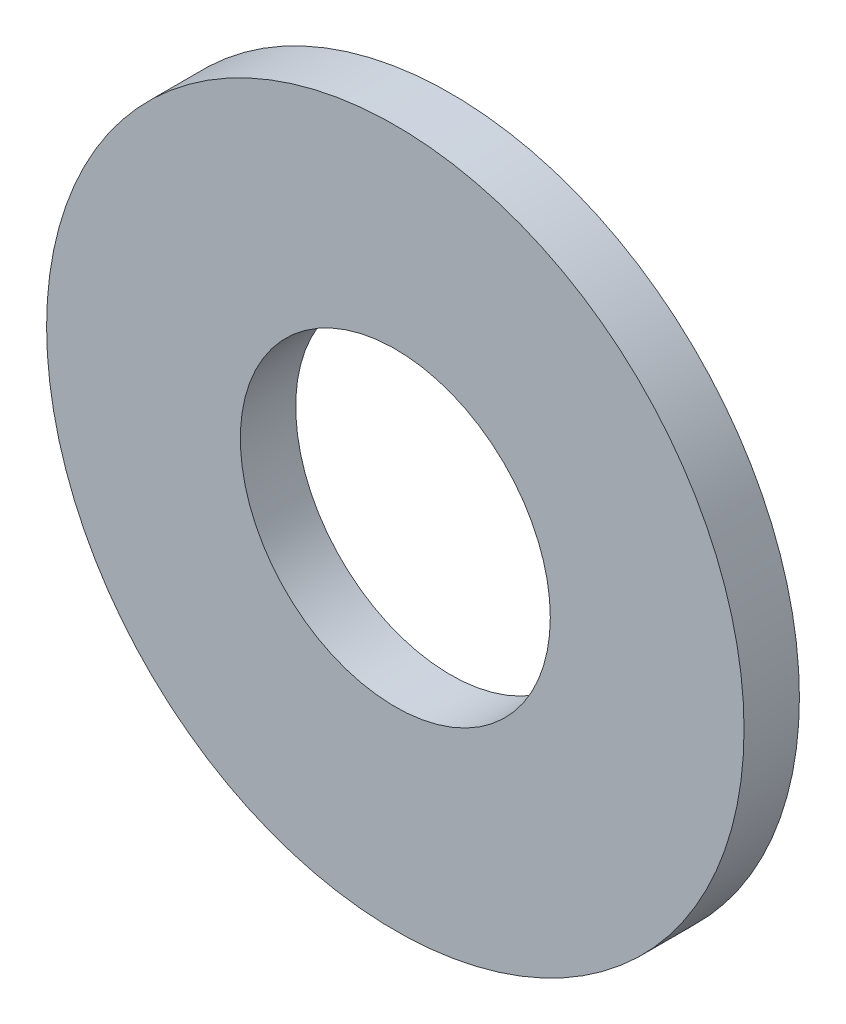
ISO-10303-21;
HEADER;
FILE_DESCRIPTION(('STEP AP214'),'2;1');
FILE_NAME('part.step','',(''),(''),'','','');
FILE_SCHEMA(('AUTOMOTIVE_DESIGN { 1 0 10303 214 1 1 1 1 }'));
ENDSEC;
DATA;
#1=APPLICATION_CONTEXT('core data for automotive mechanical design processes');
#2=APPLICATION_PROTOCOL_DEFINITION('international standard','automotive_design',2000,#1);
#3=PRODUCT_CONTEXT('',#1,'mechanical');
#4=PRODUCT('Part','Part','',(#3));
#5=PRODUCT_RELATED_PRODUCT_CATEGORY('part','',(#4));
#6=PRODUCT_DEFINITION_FORMATION('','',#4);
#7=PRODUCT_DEFINITION_CONTEXT('part definition',#1,'design');
#8=PRODUCT_DEFINITION('design','',#6,#7);
#9=PRODUCT_DEFINITION_SHAPE('','',#8);
#10=(LENGTH_UNIT() NAMED_UNIT(*) SI_UNIT(.MILLI.,.METRE.));
#11=(NAMED_UNIT(*) PLANE_ANGLE_UNIT() SI_UNIT($,.RADIAN.));
#12=(NAMED_UNIT(*) SI_UNIT($,.STERADIAN.) SOLID_ANGLE_UNIT());
#13=UNCERTAINTY_MEASURE_WITH_UNIT(LENGTH_MEASURE(1.E-05),#10,'distance_accuracy_value','');
#14=(GEOMETRIC_REPRESENTATION_CONTEXT(3) GLOBAL_UNCERTAINTY_ASSIGNED_CONTEXT((#13)) GLOBAL_UNIT_ASSIGNED_CONTEXT((#10,
#11,#12)) REPRESENTATION_CONTEXT('',''));
#15=CARTESIAN_POINT('',(0.,0.,0.));
#16=DIRECTION('',(0.,0.,1.));
#17=DIRECTION('',(1.,0.,0.));
#18=AXIS2_PLACEMENT_3D('',#15,#16,#17);
#19=CARTESIAN_POINT('',(-8.88178419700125E-13,-2.22044604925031E-13,-1.2700000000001));
#20=DIRECTION('',(0.,0.,1.));
#21=DIRECTION('',(1.00000000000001,0.,0.));
#22=AXIS2_PLACEMENT_3D('',#19,#20,#21);
#23=CYLINDRICAL_SURFACE('',#22,8.001);
#24=CARTESIAN_POINT('',(-8.88178419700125E-13,-2.22044604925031E-13,-1.2700000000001));
#25=DIRECTION('',(0.,0.,1.));
#26=DIRECTION('',(1.00000000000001,0.,0.));
#27=AXIS2_PLACEMENT_3D('',#24,#25,#26);
#28=CIRCLE('',#27,8.001);
#29=CARTESIAN_POINT('',(8.00099999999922,-2.58464472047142E-13,-1.27000000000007));
#30=VERTEX_POINT('',#29);
#31=EDGE_CURVE('E10',#30,#30,#28,.T.);
#32=ORIENTED_EDGE('',*,*,#31,.T.);
#33=EDGE_LOOP('',(#32));
#34=FACE_BOUND('',#33,.T.);
#35=CARTESIAN_POINT('',(0.,0.,0.));
#36=DIRECTION('',(0.,0.,1.));
#37=DIRECTION('',(1.00000000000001,0.,0.));
#38=AXIS2_PLACEMENT_3D('',#35,#36,#37);
#39=CIRCLE('',#38,8.001);
#40=CARTESIAN_POINT('',(8.00100000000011,0.,0.));
#41=VERTEX_POINT('',#40);
#42=EDGE_CURVE('E37',#41,#41,#39,.T.);
#43=ORIENTED_EDGE('',*,*,#42,.F.);
#44=EDGE_LOOP('',(#43));
#45=FACE_BOUND('',#44,.T.);
#46=ADVANCED_FACE('F34',(#34,#45),#23,.T.);
#47=CARTESIAN_POINT('',(-8.88178419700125E-13,-2.22044604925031E-13,-1.2700000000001));
#48=DIRECTION('',(0.,0.,1.));
#49=DIRECTION('',(1.00000000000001,0.,0.));
#50=AXIS2_PLACEMENT_3D('',#47,#48,#49);
#51=PLANE('',#50);
#52=CARTESIAN_POINT('',(-8.88178419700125E-13,-2.22044604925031E-13,-1.2700000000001));
#53=DIRECTION('',(0.,0.,1.));
#54=DIRECTION('',(1.00000000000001,0.,0.));
#55=AXIS2_PLACEMENT_3D('',#52,#53,#54);
#56=CIRCLE('',#55,3.556);
#57=CARTESIAN_POINT('',(3.55599999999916,-2.38231212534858E-13,-1.27000000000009));
#58=VERTEX_POINT('',#57);
#59=EDGE_CURVE('E44',#58,#58,#56,.T.);
#60=ORIENTED_EDGE('',*,*,#59,.T.);
#61=EDGE_LOOP('',(#60));
#62=FACE_BOUND('',#61,.T.);
#63=ORIENTED_EDGE('',*,*,#31,.F.);
#64=EDGE_LOOP('',(#63));
#65=FACE_BOUND('',#64,.T.);
#66=ADVANCED_FACE('F52',(#62,#65),#51,.F.);
#67=CARTESIAN_POINT('',(0.,0.,0.));
#68=DIRECTION('',(0.,0.,1.));
#69=DIRECTION('',(1.00000000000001,0.,0.));
#70=AXIS2_PLACEMENT_3D('',#67,#68,#69);
#71=PLANE('',#70);
#72=CARTESIAN_POINT('',(0.,0.,0.));
#73=DIRECTION('',(0.,0.,1.));
#74=DIRECTION('',(1.00000000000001,0.,0.));
#75=AXIS2_PLACEMENT_3D('',#72,#73,#74);
#76=CIRCLE('',#75,3.556);
#77=CARTESIAN_POINT('',(3.55600000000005,0.,0.));
#78=VERTEX_POINT('',#77);
#79=EDGE_CURVE('E46',#78,#78,#76,.T.);
#80=ORIENTED_EDGE('',*,*,#79,.F.);
#81=EDGE_LOOP('',(#80));
#82=FACE_BOUND('',#81,.T.);
#83=ORIENTED_EDGE('',*,*,#42,.T.);
#84=EDGE_LOOP('',(#83));
#85=FACE_BOUND('',#84,.T.);
#86=ADVANCED_FACE('F58',(#82,#85),#71,.T.);
#87=CARTESIAN_POINT('',(-8.88178419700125E-13,-2.22044604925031E-13,-1.2700000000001));
#88=DIRECTION('',(0.,0.,1.));
#89=DIRECTION('',(1.00000000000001,0.,0.));
#90=AXIS2_PLACEMENT_3D('',#87,#88,#89);
#91=CYLINDRICAL_SURFACE('',#90,3.556);
#92=ORIENTED_EDGE('',*,*,#59,.F.);
#93=EDGE_LOOP('',(#92));
#94=FACE_BOUND('',#93,.T.);
#95=ORIENTED_EDGE('',*,*,#79,.T.);
#96=EDGE_LOOP('',(#95));
#97=FACE_BOUND('',#96,.T.);
#98=ADVANCED_FACE('F55',(#94,#97),#91,.F.);
#99=CLOSED_SHELL('',(#46,#66,#86,#98));
#100=MANIFOLD_SOLID_BREP('B2',#99);
#101=ADVANCED_BREP_SHAPE_REPRESENTATION('',(#18,#100),#14);
#102=SHAPE_DEFINITION_REPRESENTATION(#9,#101);
ENDSEC;
END-ISO-10303-21;
